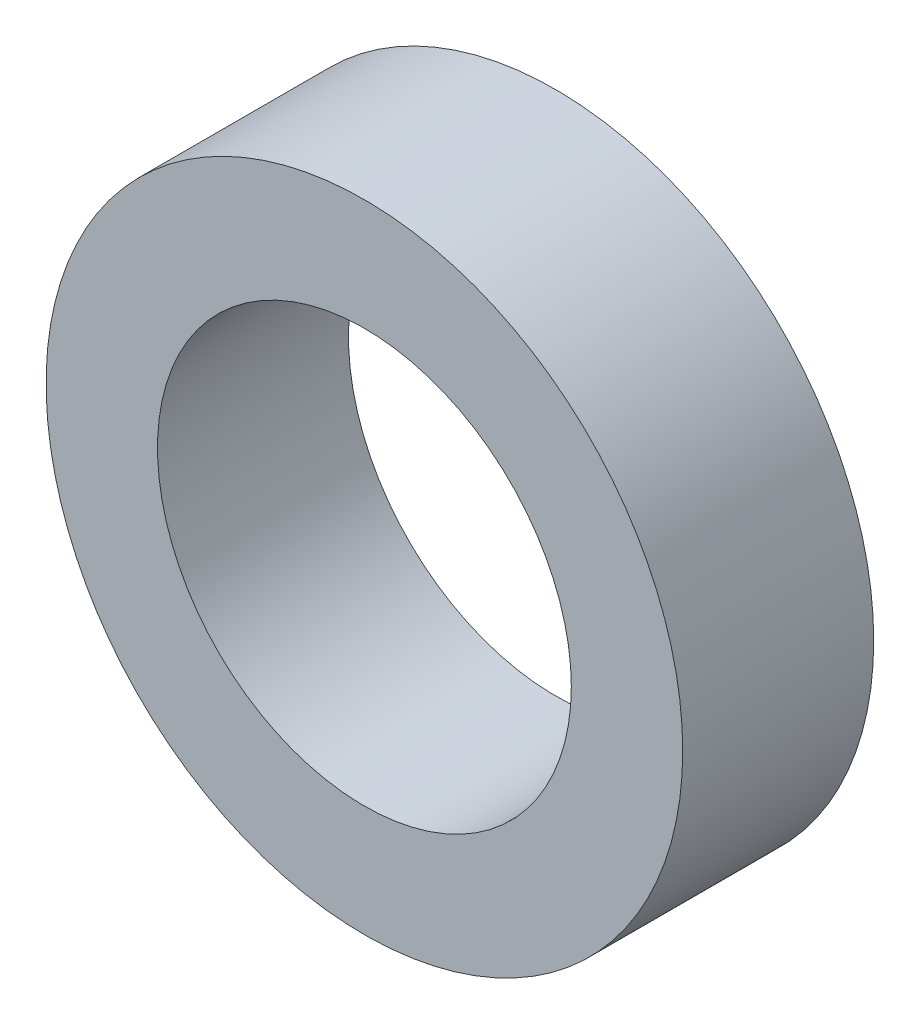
ISO-10303-21;
HEADER;
FILE_DESCRIPTION(('STEP AP214'),'2;1');
FILE_NAME('part.step','',(''),(''),'','','');
FILE_SCHEMA(('AUTOMOTIVE_DESIGN { 1 0 10303 214 1 1 1 1 }'));
ENDSEC;
DATA;
#1=APPLICATION_CONTEXT('core data for automotive mechanical design processes');
#2=APPLICATION_PROTOCOL_DEFINITION('international standard','automotive_design',2000,#1);
#3=PRODUCT_CONTEXT('',#1,'mechanical');
#4=PRODUCT('Part','Part','',(#3));
#5=PRODUCT_RELATED_PRODUCT_CATEGORY('part','',(#4));
#6=PRODUCT_DEFINITION_FORMATION('','',#4);
#7=PRODUCT_DEFINITION_CONTEXT('part definition',#1,'design');
#8=PRODUCT_DEFINITION('design','',#6,#7);
#9=PRODUCT_DEFINITION_SHAPE('','',#8);
#10=(LENGTH_UNIT() NAMED_UNIT(*) SI_UNIT(.MILLI.,.METRE.));
#11=(NAMED_UNIT(*) PLANE_ANGLE_UNIT() SI_UNIT($,.RADIAN.));
#12=(NAMED_UNIT(*) SI_UNIT($,.STERADIAN.) SOLID_ANGLE_UNIT());
#13=UNCERTAINTY_MEASURE_WITH_UNIT(LENGTH_MEASURE(1.E-05),#10,'distance_accuracy_value','');
#14=(GEOMETRIC_REPRESENTATION_CONTEXT(3) GLOBAL_UNCERTAINTY_ASSIGNED_CONTEXT((#13)) GLOBAL_UNIT_ASSIGNED_CONTEXT((#10,
#11,#12)) REPRESENTATION_CONTEXT('',''));
#15=CARTESIAN_POINT('',(0.,0.,0.));
#16=DIRECTION('',(0.,0.,1.));
#17=DIRECTION('',(1.,0.,0.));
#18=AXIS2_PLACEMENT_3D('',#15,#16,#17);
#19=CARTESIAN_POINT('',(0.,0.,3.));
#20=DIRECTION('',(0.,0.,-1.));
#21=DIRECTION('',(-1.,0.,0.));
#22=AXIS2_PLACEMENT_3D('',#19,#20,#21);
#23=CYLINDRICAL_SURFACE('',#22,5.);
#24=CARTESIAN_POINT('',(0.,0.,3.));
#25=DIRECTION('',(0.,0.,1.));
#26=DIRECTION('',(1.,0.,0.));
#27=AXIS2_PLACEMENT_3D('',#24,#25,#26);
#28=CIRCLE('',#27,5.);
#29=CARTESIAN_POINT('',(5.,0.,3.));
#30=VERTEX_POINT('',#29);
#31=EDGE_CURVE('E10',#30,#30,#28,.T.);
#32=ORIENTED_EDGE('',*,*,#31,.F.);
#33=EDGE_LOOP('',(#32));
#34=FACE_BOUND('',#33,.T.);
#35=CARTESIAN_POINT('',(0.,0.,0.));
#36=DIRECTION('',(0.,0.,1.));
#37=DIRECTION('',(1.,0.,0.));
#38=AXIS2_PLACEMENT_3D('',#35,#36,#37);
#39=CIRCLE('',#38,5.);
#40=CARTESIAN_POINT('',(5.,0.,0.));
#41=VERTEX_POINT('',#40);
#42=EDGE_CURVE('E46',#41,#41,#39,.T.);
#43=ORIENTED_EDGE('',*,*,#42,.T.);
#44=EDGE_LOOP('',(#43));
#45=FACE_BOUND('',#44,.T.);
#46=ADVANCED_FACE('F43',(#34,#45),#23,.T.);
#47=CARTESIAN_POINT('',(0.,0.,3.));
#48=DIRECTION('',(0.,0.,1.));
#49=DIRECTION('',(1.,0.,0.));
#50=AXIS2_PLACEMENT_3D('',#47,#48,#49);
#51=PLANE('',#50);
#52=CARTESIAN_POINT('',(0.,0.,3.));
#53=DIRECTION('',(0.,0.,1.));
#54=DIRECTION('',(1.,0.,0.));
#55=AXIS2_PLACEMENT_3D('',#52,#53,#54);
#56=CIRCLE('',#55,3.25);
#57=CARTESIAN_POINT('',(3.25,0.,3.));
#58=VERTEX_POINT('',#57);
#59=EDGE_CURVE('E57',#58,#58,#56,.T.);
#60=ORIENTED_EDGE('',*,*,#59,.F.);
#61=EDGE_LOOP('',(#60));
#62=FACE_BOUND('',#61,.T.);
#63=ORIENTED_EDGE('',*,*,#31,.T.);
#64=EDGE_LOOP('',(#63));
#65=FACE_BOUND('',#64,.T.);
#66=ADVANCED_FACE('F74',(#62,#65),#51,.T.);
#67=CARTESIAN_POINT('',(0.,0.,0.));
#68=DIRECTION('',(0.,0.,1.));
#69=DIRECTION('',(1.,0.,0.));
#70=AXIS2_PLACEMENT_3D('',#67,#68,#69);
#71=PLANE('',#70);
#72=CARTESIAN_POINT('',(0.,0.,0.));
#73=DIRECTION('',(0.,0.,1.));
#74=DIRECTION('',(1.,0.,0.));
#75=AXIS2_PLACEMENT_3D('',#72,#73,#74);
#76=CIRCLE('',#75,3.25);
#77=CARTESIAN_POINT('',(3.25,0.,0.));
#78=VERTEX_POINT('',#77);
#79=EDGE_CURVE('E55',#78,#78,#76,.T.);
#80=ORIENTED_EDGE('',*,*,#79,.T.);
#81=EDGE_LOOP('',(#80));
#82=FACE_BOUND('',#81,.T.);
#83=ORIENTED_EDGE('',*,*,#42,.F.);
#84=EDGE_LOOP('',(#83));
#85=FACE_BOUND('',#84,.T.);
#86=ADVANCED_FACE('F65',(#82,#85),#71,.F.);
#87=CARTESIAN_POINT('',(0.,0.,0.));
#88=DIRECTION('',(0.,0.,1.));
#89=DIRECTION('',(1.,0.,0.));
#90=AXIS2_PLACEMENT_3D('',#87,#88,#89);
#91=CYLINDRICAL_SURFACE('',#90,3.25);
#92=ORIENTED_EDGE('',*,*,#79,.F.);
#93=EDGE_LOOP('',(#92));
#94=FACE_BOUND('',#93,.T.);
#95=ORIENTED_EDGE('',*,*,#59,.T.);
#96=EDGE_LOOP('',(#95));
#97=FACE_BOUND('',#96,.T.);
#98=ADVANCED_FACE('F68',(#94,#97),#91,.F.);
#99=CLOSED_SHELL('',(#46,#66,#86,#98));
#100=MANIFOLD_SOLID_BREP('B2',#99);
#101=ADVANCED_BREP_SHAPE_REPRESENTATION('',(#18,#100),#14);
#102=SHAPE_DEFINITION_REPRESENTATION(#9,#101);
ENDSEC;
END-ISO-10303-21;
